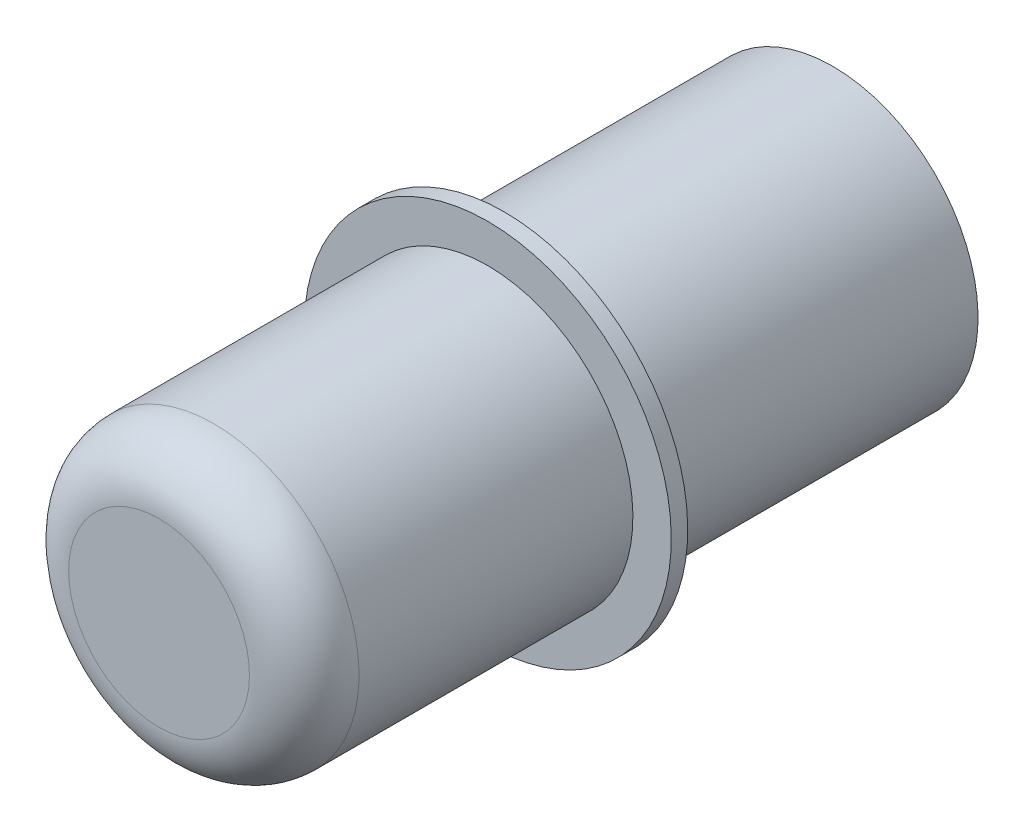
ISO-10303-21;
HEADER;
FILE_DESCRIPTION(('STEP AP214'),'2;1');
FILE_NAME('part.step','',(''),(''),'','','');
FILE_SCHEMA(('AUTOMOTIVE_DESIGN { 1 0 10303 214 1 1 1 1 }'));
ENDSEC;
DATA;
#1=APPLICATION_CONTEXT('core data for automotive mechanical design processes');
#2=APPLICATION_PROTOCOL_DEFINITION('international standard','automotive_design',2000,#1);
#3=PRODUCT_CONTEXT('',#1,'mechanical');
#4=PRODUCT('Part','Part','',(#3));
#5=PRODUCT_RELATED_PRODUCT_CATEGORY('part','',(#4));
#6=PRODUCT_DEFINITION_FORMATION('','',#4);
#7=PRODUCT_DEFINITION_CONTEXT('part definition',#1,'design');
#8=PRODUCT_DEFINITION('design','',#6,#7);
#9=PRODUCT_DEFINITION_SHAPE('','',#8);
#10=(LENGTH_UNIT() NAMED_UNIT(*) SI_UNIT(.MILLI.,.METRE.));
#11=(NAMED_UNIT(*) PLANE_ANGLE_UNIT() SI_UNIT($,.RADIAN.));
#12=(NAMED_UNIT(*) SI_UNIT($,.STERADIAN.) SOLID_ANGLE_UNIT());
#13=UNCERTAINTY_MEASURE_WITH_UNIT(LENGTH_MEASURE(1.E-05),#10,'distance_accuracy_value','');
#14=(GEOMETRIC_REPRESENTATION_CONTEXT(3) GLOBAL_UNCERTAINTY_ASSIGNED_CONTEXT((#13)) GLOBAL_UNIT_ASSIGNED_CONTEXT((#10,
#11,#12)) REPRESENTATION_CONTEXT('',''));
#15=CARTESIAN_POINT('',(0.,0.,0.));
#16=DIRECTION('',(0.,0.,1.));
#17=DIRECTION('',(1.,0.,0.));
#18=AXIS2_PLACEMENT_3D('',#15,#16,#17);
#19=CARTESIAN_POINT('',(0.,0.,0.));
#20=DIRECTION('',(0.,0.,1.));
#21=DIRECTION('',(0.,-1.,0.));
#22=AXIS2_PLACEMENT_3D('',#19,#20,#21);
#23=PLANE('',#22);
#24=CARTESIAN_POINT('',(0.,0.,0.));
#25=DIRECTION('',(0.,0.,1.));
#26=DIRECTION('',(0.,-1.,0.));
#27=AXIS2_PLACEMENT_3D('',#24,#25,#26);
#28=CIRCLE('',#27,8.25);
#29=CARTESIAN_POINT('',(0.,-8.25,0.));
#30=VERTEX_POINT('',#29);
#31=EDGE_CURVE('E10',#30,#30,#28,.T.);
#32=ORIENTED_EDGE('',*,*,#31,.T.);
#33=EDGE_LOOP('',(#32));
#34=FACE_BOUND('',#33,.T.);
#35=ADVANCED_FACE('F31',(#34),#23,.T.);
#36=CARTESIAN_POINT('',(0.,0.,-61.5));
#37=DIRECTION('',(0.,0.,-1.));
#38=DIRECTION('',(0.,1.,0.));
#39=AXIS2_PLACEMENT_3D('',#36,#37,#38);
#40=CYLINDRICAL_SURFACE('',#39,13.25);
#41=CARTESIAN_POINT('',(0.,0.,-5.));
#42=DIRECTION('',(0.,0.,1.));
#43=DIRECTION('',(0.,-1.,0.));
#44=AXIS2_PLACEMENT_3D('',#41,#42,#43);
#45=CIRCLE('',#44,13.25);
#46=CARTESIAN_POINT('',(0.,-13.25,-5.));
#47=VERTEX_POINT('',#46);
#48=EDGE_CURVE('E38',#47,#47,#45,.F.);
#49=ORIENTED_EDGE('',*,*,#48,.T.);
#50=EDGE_LOOP('',(#49));
#51=FACE_BOUND('',#50,.T.);
#52=CARTESIAN_POINT('',(0.,0.,-30.));
#53=DIRECTION('',(0.,0.,-1.));
#54=DIRECTION('',(0.,1.,0.));
#55=AXIS2_PLACEMENT_3D('',#52,#53,#54);
#56=CIRCLE('',#55,13.25);
#57=CARTESIAN_POINT('',(0.,13.25,-30.));
#58=VERTEX_POINT('',#57);
#59=EDGE_CURVE('E42',#58,#58,#56,.T.);
#60=ORIENTED_EDGE('',*,*,#59,.F.);
#61=EDGE_LOOP('',(#60));
#62=FACE_BOUND('',#61,.T.);
#63=ADVANCED_FACE('F93',(#51,#62),#40,.T.);
#64=CARTESIAN_POINT('',(0.,13.25,-30.));
#65=DIRECTION('',(0.,0.,1.));
#66=DIRECTION('',(0.,-1.,0.));
#67=AXIS2_PLACEMENT_3D('',#64,#65,#66);
#68=PLANE('',#67);
#69=ORIENTED_EDGE('',*,*,#59,.T.);
#70=EDGE_LOOP('',(#69));
#71=FACE_BOUND('',#70,.T.);
#72=CARTESIAN_POINT('',(0.,0.,-30.));
#73=DIRECTION('',(0.,0.,-1.));
#74=DIRECTION('',(0.,1.,0.));
#75=AXIS2_PLACEMENT_3D('',#72,#73,#74);
#76=CIRCLE('',#75,16.75);
#77=CARTESIAN_POINT('',(0.,16.75,-30.));
#78=VERTEX_POINT('',#77);
#79=EDGE_CURVE('E46',#78,#78,#76,.T.);
#80=ORIENTED_EDGE('',*,*,#79,.F.);
#81=EDGE_LOOP('',(#80));
#82=FACE_BOUND('',#81,.T.);
#83=ADVANCED_FACE('F97',(#71,#82),#68,.T.);
#84=CARTESIAN_POINT('',(0.,0.,-61.5));
#85=DIRECTION('',(0.,0.,-1.));
#86=DIRECTION('',(0.,1.,0.));
#87=AXIS2_PLACEMENT_3D('',#84,#85,#86);
#88=CYLINDRICAL_SURFACE('',#87,16.75);
#89=ORIENTED_EDGE('',*,*,#79,.T.);
#90=EDGE_LOOP('',(#89));
#91=FACE_BOUND('',#90,.T.);
#92=CARTESIAN_POINT('',(0.,0.,-31.5));
#93=DIRECTION('',(0.,0.,-1.));
#94=DIRECTION('',(0.,1.,0.));
#95=AXIS2_PLACEMENT_3D('',#92,#93,#94);
#96=CIRCLE('',#95,16.75);
#97=CARTESIAN_POINT('',(0.,16.75,-31.5));
#98=VERTEX_POINT('',#97);
#99=EDGE_CURVE('E51',#98,#98,#96,.T.);
#100=ORIENTED_EDGE('',*,*,#99,.F.);
#101=EDGE_LOOP('',(#100));
#102=FACE_BOUND('',#101,.T.);
#103=ADVANCED_FACE('F89',(#91,#102),#88,.T.);
#104=CARTESIAN_POINT('',(0.,16.75,-31.5));
#105=DIRECTION('',(0.,0.,-1.));
#106=DIRECTION('',(0.,1.,0.));
#107=AXIS2_PLACEMENT_3D('',#104,#105,#106);
#108=PLANE('',#107);
#109=ORIENTED_EDGE('',*,*,#99,.T.);
#110=EDGE_LOOP('',(#109));
#111=FACE_BOUND('',#110,.T.);
#112=CARTESIAN_POINT('',(0.,0.,-31.5));
#113=DIRECTION('',(0.,0.,-1.));
#114=DIRECTION('',(0.,1.,0.));
#115=AXIS2_PLACEMENT_3D('',#112,#113,#114);
#116=CIRCLE('',#115,13.25);
#117=CARTESIAN_POINT('',(0.,13.25,-31.5));
#118=VERTEX_POINT('',#117);
#119=EDGE_CURVE('E54',#118,#118,#116,.T.);
#120=ORIENTED_EDGE('',*,*,#119,.F.);
#121=EDGE_LOOP('',(#120));
#122=FACE_BOUND('',#121,.T.);
#123=ADVANCED_FACE('F83',(#111,#122),#108,.T.);
#124=CARTESIAN_POINT('',(0.,0.,-61.5));
#125=DIRECTION('',(0.,0.,-1.));
#126=DIRECTION('',(0.,1.,0.));
#127=AXIS2_PLACEMENT_3D('',#124,#125,#126);
#128=CYLINDRICAL_SURFACE('',#127,13.25);
#129=ORIENTED_EDGE('',*,*,#119,.T.);
#130=EDGE_LOOP('',(#129));
#131=FACE_BOUND('',#130,.T.);
#132=CARTESIAN_POINT('',(0.,0.,-61.5));
#133=DIRECTION('',(0.,0.,-1.));
#134=DIRECTION('',(0.,1.,0.));
#135=AXIS2_PLACEMENT_3D('',#132,#133,#134);
#136=CIRCLE('',#135,13.25);
#137=CARTESIAN_POINT('',(0.,13.25,-61.5));
#138=VERTEX_POINT('',#137);
#139=EDGE_CURVE('E57',#138,#138,#136,.T.);
#140=ORIENTED_EDGE('',*,*,#139,.F.);
#141=EDGE_LOOP('',(#140));
#142=FACE_BOUND('',#141,.T.);
#143=ADVANCED_FACE('F78',(#131,#142),#128,.T.);
#144=CARTESIAN_POINT('',(0.,13.25,-61.5));
#145=DIRECTION('',(0.,0.,-1.));
#146=DIRECTION('',(0.,1.,0.));
#147=AXIS2_PLACEMENT_3D('',#144,#145,#146);
#148=PLANE('',#147);
#149=CARTESIAN_POINT('',(0.,0.,-61.5));
#150=DIRECTION('',(0.,0.,-1.));
#151=DIRECTION('',(0.,1.,0.));
#152=AXIS2_PLACEMENT_3D('',#149,#150,#151);
#153=CIRCLE('',#152,7.);
#154=CARTESIAN_POINT('',(0.,7.,-61.5));
#155=VERTEX_POINT('',#154);
#156=EDGE_CURVE('E61',#155,#155,#153,.T.);
#157=ORIENTED_EDGE('',*,*,#156,.F.);
#158=EDGE_LOOP('',(#157));
#159=FACE_BOUND('',#158,.T.);
#160=ORIENTED_EDGE('',*,*,#139,.T.);
#161=EDGE_LOOP('',(#160));
#162=FACE_BOUND('',#161,.T.);
#163=ADVANCED_FACE('F75',(#159,#162),#148,.T.);
#164=CARTESIAN_POINT('',(0.,0.,-5.));
#165=DIRECTION('',(0.,0.,1.));
#166=DIRECTION('',(0.,-1.,0.));
#167=AXIS2_PLACEMENT_3D('',#164,#165,#166);
#168=TOROIDAL_SURFACE('',#167,8.25,5.);
#169=ORIENTED_EDGE('',*,*,#31,.F.);
#170=EDGE_LOOP('',(#169));
#171=FACE_BOUND('',#170,.T.);
#172=ORIENTED_EDGE('',*,*,#48,.F.);
#173=EDGE_LOOP('',(#172));
#174=FACE_BOUND('',#173,.T.);
#175=ADVANCED_FACE('F33',(#171,#174),#168,.T.);
#176=CARTESIAN_POINT('',(0.,0.,-43.5));
#177=DIRECTION('',(0.,0.,-1.));
#178=DIRECTION('',(0.,1.,0.));
#179=AXIS2_PLACEMENT_3D('',#176,#177,#178);
#180=CYLINDRICAL_SURFACE('',#179,7.);
#181=CARTESIAN_POINT('',(0.,0.,-43.5));
#182=DIRECTION('',(0.,0.,-1.));
#183=DIRECTION('',(0.,1.,0.));
#184=AXIS2_PLACEMENT_3D('',#181,#182,#183);
#185=CIRCLE('',#184,7.);
#186=CARTESIAN_POINT('',(0.,7.,-43.5));
#187=VERTEX_POINT('',#186);
#188=EDGE_CURVE('E60',#187,#187,#185,.T.);
#189=ORIENTED_EDGE('',*,*,#188,.F.);
#190=EDGE_LOOP('',(#189));
#191=FACE_BOUND('',#190,.T.);
#192=ORIENTED_EDGE('',*,*,#156,.T.);
#193=EDGE_LOOP('',(#192));
#194=FACE_BOUND('',#193,.T.);
#195=ADVANCED_FACE('F69',(#191,#194),#180,.F.);
#196=CARTESIAN_POINT('',(0.,0.,-43.5));
#197=DIRECTION('',(0.,0.,-1.));
#198=DIRECTION('',(0.,1.,0.));
#199=AXIS2_PLACEMENT_3D('',#196,#197,#198);
#200=PLANE('',#199);
#201=ORIENTED_EDGE('',*,*,#188,.T.);
#202=EDGE_LOOP('',(#201));
#203=FACE_BOUND('',#202,.T.);
#204=ADVANCED_FACE('F67',(#203),#200,.T.);
#205=CLOSED_SHELL('',(#35,#63,#83,#103,#123,#143,#163,#175,#195,#204));
#206=MANIFOLD_SOLID_BREP('B2',#205);
#207=ADVANCED_BREP_SHAPE_REPRESENTATION('',(#18,#206),#14);
#208=SHAPE_DEFINITION_REPRESENTATION(#9,#207);
ENDSEC;
END-ISO-10303-21;
